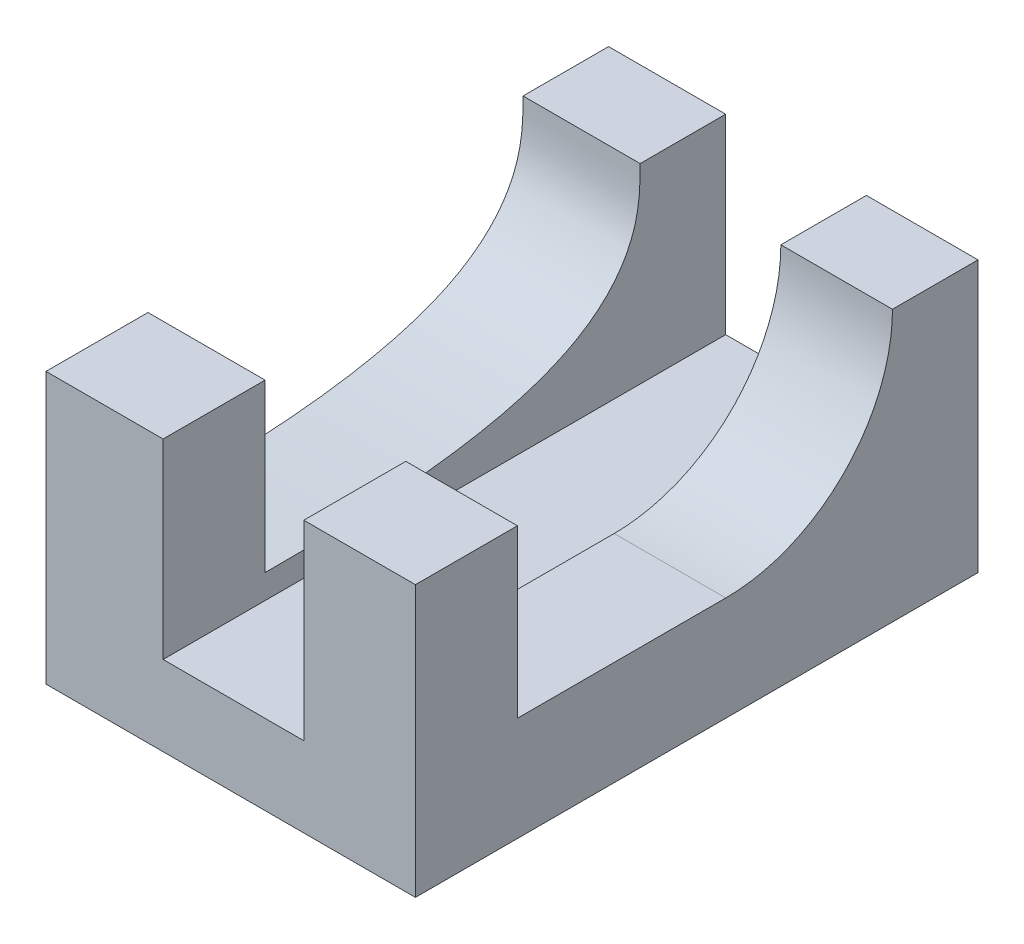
ISO-10303-21;
HEADER;
FILE_DESCRIPTION(('STEP AP214'),'2;1');
FILE_NAME('part.step','',(''),(''),'','','');
FILE_SCHEMA(('AUTOMOTIVE_DESIGN { 1 0 10303 214 1 1 1 1 }'));
ENDSEC;
DATA;
#1=APPLICATION_CONTEXT('core data for automotive mechanical design processes');
#2=APPLICATION_PROTOCOL_DEFINITION('international standard','automotive_design',2000,#1);
#3=PRODUCT_CONTEXT('',#1,'mechanical');
#4=PRODUCT('Part','Part','',(#3));
#5=PRODUCT_RELATED_PRODUCT_CATEGORY('part','',(#4));
#6=PRODUCT_DEFINITION_FORMATION('','',#4);
#7=PRODUCT_DEFINITION_CONTEXT('part definition',#1,'design');
#8=PRODUCT_DEFINITION('design','',#6,#7);
#9=PRODUCT_DEFINITION_SHAPE('','',#8);
#10=(LENGTH_UNIT() NAMED_UNIT(*) SI_UNIT(.MILLI.,.METRE.));
#11=(NAMED_UNIT(*) PLANE_ANGLE_UNIT() SI_UNIT($,.RADIAN.));
#12=(NAMED_UNIT(*) SI_UNIT($,.STERADIAN.) SOLID_ANGLE_UNIT());
#13=UNCERTAINTY_MEASURE_WITH_UNIT(LENGTH_MEASURE(1.E-05),#10,'distance_accuracy_value','');
#14=(GEOMETRIC_REPRESENTATION_CONTEXT(3) GLOBAL_UNCERTAINTY_ASSIGNED_CONTEXT((#13)) GLOBAL_UNIT_ASSIGNED_CONTEXT((#10,
#11,#12)) REPRESENTATION_CONTEXT('',''));
#15=CARTESIAN_POINT('',(0.,0.,0.));
#16=DIRECTION('',(0.,0.,1.));
#17=DIRECTION('',(1.,0.,0.));
#18=AXIS2_PLACEMENT_3D('',#15,#16,#17);
#19=CARTESIAN_POINT('',(-9.53202717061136,17.7663989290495,-17.3923694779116));
#20=CARTESIAN_POINT('',(-17.5203809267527,17.7663989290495,-17.3923694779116));
#21=CARTESIAN_POINT('',(-25.5087346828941,17.7663989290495,-17.3923694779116));
#22=CARTESIAN_POINT('',(-33.4970884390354,17.7663989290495,-17.3923694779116));
#23=CARTESIAN_POINT('',(-9.53202717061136,17.7663989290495,-28.1501547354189));
#24=CARTESIAN_POINT('',(-17.5203809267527,17.7663989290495,-28.1501547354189));
#25=CARTESIAN_POINT('',(-25.5087346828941,17.7663989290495,-28.1501547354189));
#26=CARTESIAN_POINT('',(-33.4970884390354,17.7663989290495,-28.1501547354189));
#27=CARTESIAN_POINT('',(-9.53202717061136,17.7663989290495,-38.9079399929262));
#28=CARTESIAN_POINT('',(-17.5203809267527,17.7663989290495,-38.9079399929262));
#29=CARTESIAN_POINT('',(-25.5087346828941,17.7663989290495,-38.9079399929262));
#30=CARTESIAN_POINT('',(-33.4970884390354,17.7663989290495,-38.9079399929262));
#31=CARTESIAN_POINT('',(-9.53202717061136,19.8043305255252,-62.6182376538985));
#32=CARTESIAN_POINT('',(-17.5203809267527,19.8043305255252,-62.6182376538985));
#33=CARTESIAN_POINT('',(-25.5087346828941,19.8043305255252,-62.6182376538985));
#34=CARTESIAN_POINT('',(-33.4970884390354,19.8043305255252,-62.6182376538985));
#35=CARTESIAN_POINT('',(-9.53202717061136,26.0922513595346,-76.7660595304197));
#36=CARTESIAN_POINT('',(-17.5203809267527,26.0922513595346,-76.7660595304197));
#37=CARTESIAN_POINT('',(-25.5087346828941,26.0922513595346,-76.7660595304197));
#38=CARTESIAN_POINT('',(-33.4970884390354,26.0922513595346,-76.7660595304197));
#39=CARTESIAN_POINT('',(-9.53202717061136,36.6301614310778,-81.3514056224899));
#40=CARTESIAN_POINT('',(-17.5203809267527,36.6301614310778,-81.3514056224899));
#41=CARTESIAN_POINT('',(-25.5087346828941,36.6301614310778,-81.3514056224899));
#42=CARTESIAN_POINT('',(-33.4970884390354,36.6301614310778,-81.3514056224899));
#43=CARTESIAN_POINT('',(-9.53202717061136,41.4113993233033,-81.3514056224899));
#44=CARTESIAN_POINT('',(-17.5203809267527,41.4113993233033,-81.3514056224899));
#45=CARTESIAN_POINT('',(-25.5087346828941,41.4113993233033,-81.3514056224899));
#46=CARTESIAN_POINT('',(-33.4970884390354,41.4113993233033,-81.3514056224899));
#47=CARTESIAN_POINT('',(-9.53202717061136,46.1926372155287,-81.3514056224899));
#48=CARTESIAN_POINT('',(-17.5203809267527,46.1926372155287,-81.3514056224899));
#49=CARTESIAN_POINT('',(-25.5087346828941,46.1926372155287,-81.3514056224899));
#50=CARTESIAN_POINT('',(-33.4970884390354,46.1926372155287,-81.3514056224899));
#51=B_SPLINE_SURFACE_WITH_KNOTS('',5,3,((#19,#20,#21,#22),(#23,#24,#25,#26),(#27,#28,#29,#30),
(#31,#32,#33,#34),(#35,#36,#37,#38),(#39,#40,#41,#42),(#43,#44,#45,#46),(#47,#48,#49,#50)),
.UNSPECIFIED.,.F.,.F.,.F.,(6,2,6),(4,4),(0.,0.5,1.),(0.0410320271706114,0.0649970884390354),.UNSPECIFIED.);
#52=CARTESIAN_POINT('',(-9.53202717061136,46.1926372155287,-81.3514056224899));
#53=CARTESIAN_POINT('',(-17.5203809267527,46.1926372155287,-81.3514056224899));
#54=CARTESIAN_POINT('',(-25.5087346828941,46.1926372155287,-81.3514056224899));
#55=CARTESIAN_POINT('',(-33.4970884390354,46.1926372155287,-81.3514056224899));
#56=B_SPLINE_CURVE_WITH_KNOTS('',3,(#52,#53,#54,#55),.UNSPECIFIED.,.F.,.F.,(4,4),
(0.0410320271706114,0.0649970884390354),.UNSPECIFIED.);
#57=CARTESIAN_POINT('',(-11.5291156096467,46.1926372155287,-81.3514056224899));
#58=VERTEX_POINT('',#57);
#59=CARTESIAN_POINT('',(-31.5,46.1926372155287,-81.3514056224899));
#60=VERTEX_POINT('',#59);
#61=EDGE_CURVE('E325',#58,#60,#56,.T.);
#62=CARTESIAN_POINT('',(-31.5,46.1926372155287,-81.3514056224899));
#63=CARTESIAN_POINT('',(-31.5,41.4113993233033,-81.3514056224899));
#64=CARTESIAN_POINT('',(-31.5,36.6301614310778,-81.3514056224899));
#65=CARTESIAN_POINT('',(-31.5,26.0922513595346,-76.7660595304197));
#66=CARTESIAN_POINT('',(-31.5,19.8043305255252,-62.6182376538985));
#67=CARTESIAN_POINT('',(-31.5,17.7663989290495,-38.9079399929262));
#68=CARTESIAN_POINT('',(-31.5,17.7663989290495,-28.1501547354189));
#69=CARTESIAN_POINT('',(-31.5,17.7663989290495,-17.3923694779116));
#70=B_SPLINE_CURVE_WITH_KNOTS('',5,(#62,#63,#64,#65,#66,#67,#68,#69),.UNSPECIFIED.,.F.,.F.,(6,2,
6),(0.,0.5,1.),.UNSPECIFIED.);
#71=CARTESIAN_POINT('',(-31.5,17.7663989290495,-17.3923694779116));
#72=VERTEX_POINT('',#71);
#73=EDGE_CURVE('E39',#60,#72,#70,.T.);
#74=CARTESIAN_POINT('',(-33.4970884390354,17.7663989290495,-17.3923694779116));
#75=CARTESIAN_POINT('',(-25.5087346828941,17.7663989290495,-17.3923694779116));
#76=CARTESIAN_POINT('',(-17.5203809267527,17.7663989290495,-17.3923694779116));
#77=CARTESIAN_POINT('',(-9.53202717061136,17.7663989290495,-17.3923694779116));
#78=B_SPLINE_CURVE_WITH_KNOTS('',3,(#74,#75,#76,#77),.UNSPECIFIED.,.F.,.F.,(4,4),
(0.0410320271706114,0.0649970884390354),.UNSPECIFIED.);
#79=CARTESIAN_POINT('',(-11.5291156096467,17.7663989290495,-17.3923694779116));
#80=VERTEX_POINT('',#79);
#81=EDGE_CURVE('E280',#80,#72,#78,.F.);
#82=CARTESIAN_POINT('',(-11.5291156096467,17.7663989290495,-17.3923694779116));
#83=CARTESIAN_POINT('',(-11.5291156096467,17.7663989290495,-28.1501547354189));
#84=CARTESIAN_POINT('',(-11.5291156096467,17.7663989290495,-38.9079399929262));
#85=CARTESIAN_POINT('',(-11.5291156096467,19.8043305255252,-62.6182376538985));
#86=CARTESIAN_POINT('',(-11.5291156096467,26.0922513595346,-76.7660595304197));
#87=CARTESIAN_POINT('',(-11.5291156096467,36.6301614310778,-81.3514056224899));
#88=CARTESIAN_POINT('',(-11.5291156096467,41.4113993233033,-81.3514056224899));
#89=CARTESIAN_POINT('',(-11.5291156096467,46.1926372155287,-81.3514056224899));
#90=B_SPLINE_CURVE_WITH_KNOTS('',5,(#82,#83,#84,#85,#86,#87,#88,#89),.UNSPECIFIED.,.F.,.F.,(6,2,
6),(0.,0.5,1.),.UNSPECIFIED.);
#91=EDGE_CURVE('E11',#80,#58,#90,.T.);
#92=ORIENTED_EDGE('',*,*,#61,.T.);
#93=ORIENTED_EDGE('',*,*,#73,.T.);
#94=ORIENTED_EDGE('',*,*,#81,.F.);
#95=ORIENTED_EDGE('',*,*,#91,.T.);
#96=EDGE_LOOP('',(#92,#93,#94,#95));
#97=FACE_BOUND('',#96,.T.);
#98=ADVANCED_FACE('F26',(#97),#51,.T.);
#99=CARTESIAN_POINT('',(33.4033557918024,17.7663989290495,-52.9251673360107));
#100=CARTESIAN_POINT('',(25.7899326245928,17.7663989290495,-52.9251673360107));
#101=CARTESIAN_POINT('',(18.176509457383,17.7663989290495,-52.9251673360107));
#102=CARTESIAN_POINT('',(10.5630862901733,17.7663989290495,-52.9251673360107));
#103=CARTESIAN_POINT('',(33.4033557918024,17.7663989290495,-81.3514056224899));
#104=CARTESIAN_POINT('',(25.7899326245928,17.7663989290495,-81.3514056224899));
#105=CARTESIAN_POINT('',(18.176509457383,17.7663989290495,-81.3514056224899));
#106=CARTESIAN_POINT('',(10.5630862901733,17.7663989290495,-81.3514056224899));
#107=CARTESIAN_POINT('',(33.4033557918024,46.1926372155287,-81.3514056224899));
#108=CARTESIAN_POINT('',(25.7899326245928,46.1926372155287,-81.3514056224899));
#109=CARTESIAN_POINT('',(18.176509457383,46.1926372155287,-81.3514056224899));
#110=CARTESIAN_POINT('',(10.5630862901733,46.1926372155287,-81.3514056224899));
#111=(BOUNDED_SURFACE() B_SPLINE_SURFACE(2,3,((#99,#100,#101,#102),(#103,#104,#105,#106),(#107,
#108,#109,#110)),.UNSPECIFIED.,.F.,.F.,.F.) B_SPLINE_SURFACE_WITH_KNOTS((3,3),(4,4),(0.,1.),
(-0.00190335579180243,0.0209369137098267),
.UNSPECIFIED.) GEOMETRIC_REPRESENTATION_ITEM() RATIONAL_B_SPLINE_SURFACE(((1.,1.,1.,1.),
(0.707106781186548,0.707106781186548,0.707106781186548,0.707106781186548),(1.,1.,1.,1.))) REPRESENTATION_ITEM('') SURFACE());
#112=CARTESIAN_POINT('',(33.4033557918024,46.1926372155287,-81.3514056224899));
#113=CARTESIAN_POINT('',(25.7899326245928,46.1926372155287,-81.3514056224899));
#114=CARTESIAN_POINT('',(18.176509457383,46.1926372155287,-81.3514056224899));
#115=CARTESIAN_POINT('',(10.5630862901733,46.1926372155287,-81.3514056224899));
#116=(BOUNDED_CURVE() B_SPLINE_CURVE(3,(#112,#113,#114,#115),.UNSPECIFIED.,.F.,
.F.) B_SPLINE_CURVE_WITH_KNOTS((4,4),(-0.00190335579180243,0.0209369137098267),
.UNSPECIFIED.) CURVE() GEOMETRIC_REPRESENTATION_ITEM() RATIONAL_B_SPLINE_CURVE((1.,1.,1.,1.)) REPRESENTATION_ITEM(''));
#117=CARTESIAN_POINT('',(31.5,46.1926372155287,-81.3514056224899));
#118=VERTEX_POINT('',#117);
#119=CARTESIAN_POINT('',(12.4664420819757,46.1926372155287,-81.3514056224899));
#120=VERTEX_POINT('',#119);
#121=EDGE_CURVE('E231',#118,#120,#116,.T.);
#122=CARTESIAN_POINT('',(12.4664420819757,46.1926372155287,-81.3514056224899));
#123=CARTESIAN_POINT('',(12.4664420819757,17.7663989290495,-81.3514056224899));
#124=CARTESIAN_POINT('',(12.4664420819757,17.7663989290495,-52.9251673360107));
#125=(BOUNDED_CURVE() B_SPLINE_CURVE(2,(#122,#123,#124),.UNSPECIFIED.,.F.,
.F.) B_SPLINE_CURVE_WITH_KNOTS((3,3),(0.,1.),
.UNSPECIFIED.) CURVE() GEOMETRIC_REPRESENTATION_ITEM() RATIONAL_B_SPLINE_CURVE((1.,
0.707106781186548,1.)) REPRESENTATION_ITEM(''));
#126=CARTESIAN_POINT('',(12.4664420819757,17.7663989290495,-52.9251673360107));
#127=VERTEX_POINT('',#126);
#128=EDGE_CURVE('E54',#120,#127,#125,.T.);
#129=CARTESIAN_POINT('',(10.5630862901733,17.7663989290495,-52.9251673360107));
#130=CARTESIAN_POINT('',(18.176509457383,17.7663989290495,-52.9251673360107));
#131=CARTESIAN_POINT('',(25.7899326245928,17.7663989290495,-52.9251673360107));
#132=CARTESIAN_POINT('',(33.4033557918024,17.7663989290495,-52.9251673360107));
#133=(BOUNDED_CURVE() B_SPLINE_CURVE(3,(#129,#130,#131,#132),.UNSPECIFIED.,.F.,
.F.) B_SPLINE_CURVE_WITH_KNOTS((4,4),(-0.00190335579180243,0.0209369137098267),
.UNSPECIFIED.) CURVE() GEOMETRIC_REPRESENTATION_ITEM() RATIONAL_B_SPLINE_CURVE((1.,1.,1.,1.)) REPRESENTATION_ITEM(''));
#134=CARTESIAN_POINT('',(31.5,17.7663989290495,-52.9251673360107));
#135=VERTEX_POINT('',#134);
#136=EDGE_CURVE('E185',#135,#127,#133,.F.);
#137=CARTESIAN_POINT('',(31.5,17.7663989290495,-52.9251673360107));
#138=CARTESIAN_POINT('',(31.5,17.7663989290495,-81.3514056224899));
#139=CARTESIAN_POINT('',(31.5,46.1926372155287,-81.3514056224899));
#140=(BOUNDED_CURVE() B_SPLINE_CURVE(2,(#137,#138,#139),.UNSPECIFIED.,.F.,
.F.) B_SPLINE_CURVE_WITH_KNOTS((3,3),(0.,1.),
.UNSPECIFIED.) CURVE() GEOMETRIC_REPRESENTATION_ITEM() RATIONAL_B_SPLINE_CURVE((1.,
0.707106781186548,1.)) REPRESENTATION_ITEM(''));
#141=EDGE_CURVE('E46',#135,#118,#140,.T.);
#142=ORIENTED_EDGE('',*,*,#121,.T.);
#143=ORIENTED_EDGE('',*,*,#128,.T.);
#144=ORIENTED_EDGE('',*,*,#136,.F.);
#145=ORIENTED_EDGE('',*,*,#141,.T.);
#146=EDGE_LOOP('',(#142,#143,#144,#145));
#147=FACE_BOUND('',#146,.T.);
#148=ADVANCED_FACE('F190',(#147),#111,.T.);
#149=CARTESIAN_POINT('',(31.5,46.1926372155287,-17.3923694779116));
#150=DIRECTION('',(0.,-1.,0.));
#151=DIRECTION('',(0.,0.,-1.));
#152=AXIS2_PLACEMENT_3D('',#149,#150,#151);
#153=PLANE('',#152);
#154=DIRECTION('',(-1.,0.,0.));
#155=VECTOR('',#154,1.);
#156=CARTESIAN_POINT('',(31.5,46.1926372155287,-17.3923694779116));
#157=LINE('',#156,#155);
#158=CARTESIAN_POINT('',(31.5,46.1926372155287,-17.3923694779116));
#159=VERTEX_POINT('',#158);
#160=CARTESIAN_POINT('',(12.4664420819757,46.1926372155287,-17.3923694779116));
#161=VERTEX_POINT('',#160);
#162=EDGE_CURVE('E409',#159,#161,#157,.T.);
#163=ORIENTED_EDGE('',*,*,#162,.T.);
#164=DIRECTION('',(0.,0.,-1.));
#165=VECTOR('',#164,1.);
#166=CARTESIAN_POINT('',(12.4664420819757,46.1926372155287,0.));
#167=LINE('',#166,#165);
#168=CARTESIAN_POINT('',(12.4664420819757,46.1926372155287,0.));
#169=VERTEX_POINT('',#168);
#170=EDGE_CURVE('E172',#169,#161,#167,.T.);
#171=ORIENTED_EDGE('',*,*,#170,.F.);
#172=DIRECTION('',(-1.,0.,0.));
#173=VECTOR('',#172,1.);
#174=CARTESIAN_POINT('',(31.5,46.1926372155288,0.));
#175=LINE('',#174,#173);
#176=CARTESIAN_POINT('',(31.5,46.1926372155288,0.));
#177=VERTEX_POINT('',#176);
#178=EDGE_CURVE('E370',#177,#169,#175,.T.);
#179=ORIENTED_EDGE('',*,*,#178,.F.);
#180=DIRECTION('',(0.,0.,1.));
#181=VECTOR('',#180,1.);
#182=CARTESIAN_POINT('',(31.5,46.1926372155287,-17.3923694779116));
#183=LINE('',#182,#181);
#184=EDGE_CURVE('E397',#159,#177,#183,.T.);
#185=ORIENTED_EDGE('',*,*,#184,.F.);
#186=EDGE_LOOP('',(#163,#171,#179,#185));
#187=FACE_BOUND('',#186,.T.);
#188=ADVANCED_FACE('F201',(#187),#153,.F.);
#189=CARTESIAN_POINT('',(31.5,46.1926372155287,-95.9385542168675));
#190=DIRECTION('',(0.,-1.,0.));
#191=DIRECTION('',(0.,0.,-1.));
#192=AXIS2_PLACEMENT_3D('',#189,#190,#191);
#193=PLANE('',#192);
#194=DIRECTION('',(-1.,0.,0.));
#195=VECTOR('',#194,1.);
#196=CARTESIAN_POINT('',(31.5,46.1926372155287,-95.9385542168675));
#197=LINE('',#196,#195);
#198=CARTESIAN_POINT('',(31.5,46.1926372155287,-95.9385542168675));
#199=VERTEX_POINT('',#198);
#200=CARTESIAN_POINT('',(12.4664420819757,46.1926372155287,-95.9385542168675));
#201=VERTEX_POINT('',#200);
#202=EDGE_CURVE('E414',#199,#201,#197,.T.);
#203=ORIENTED_EDGE('',*,*,#202,.T.);
#204=EDGE_CURVE('E156',#120,#201,#167,.T.);
#205=ORIENTED_EDGE('',*,*,#204,.F.);
#206=ORIENTED_EDGE('',*,*,#121,.F.);
#207=DIRECTION('',(0.,0.,1.));
#208=VECTOR('',#207,1.);
#209=CARTESIAN_POINT('',(31.5,46.1926372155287,-95.9385542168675));
#210=LINE('',#209,#208);
#211=EDGE_CURVE('E235',#199,#118,#210,.T.);
#212=ORIENTED_EDGE('',*,*,#211,.F.);
#213=EDGE_LOOP('',(#203,#205,#206,#212));
#214=FACE_BOUND('',#213,.T.);
#215=ADVANCED_FACE('F248',(#214),#193,.F.);
#216=CARTESIAN_POINT('',(31.5,17.7663989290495,-81.3514056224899));
#217=DIRECTION('',(0.,-1.,0.));
#218=DIRECTION('',(0.,0.,-1.));
#219=AXIS2_PLACEMENT_3D('',#216,#217,#218);
#220=PLANE('',#219);
#221=DIRECTION('',(0.,0.,1.));
#222=VECTOR('',#221,1.);
#223=CARTESIAN_POINT('',(31.5,17.7663989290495,-81.3514056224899));
#224=LINE('',#223,#222);
#225=CARTESIAN_POINT('',(31.5,17.7663989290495,-17.3923694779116));
#226=VERTEX_POINT('',#225);
#227=EDGE_CURVE('E385',#135,#226,#224,.T.);
#228=ORIENTED_EDGE('',*,*,#227,.F.);
#229=ORIENTED_EDGE('',*,*,#136,.T.);
#230=DIRECTION('',(0.,0.,1.));
#231=VECTOR('',#230,1.);
#232=CARTESIAN_POINT('',(12.4664420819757,17.7663989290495,-81.3514056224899));
#233=LINE('',#232,#231);
#234=CARTESIAN_POINT('',(12.4664420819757,17.7663989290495,-17.3923694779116));
#235=VERTEX_POINT('',#234);
#236=EDGE_CURVE('E175',#127,#235,#233,.T.);
#237=ORIENTED_EDGE('',*,*,#236,.T.);
#238=DIRECTION('',(-1.,0.,0.));
#239=VECTOR('',#238,1.);
#240=CARTESIAN_POINT('',(31.5,17.7663989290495,-17.3923694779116));
#241=LINE('',#240,#239);
#242=EDGE_CURVE('E336',#226,#235,#241,.T.);
#243=ORIENTED_EDGE('',*,*,#242,.F.);
#244=EDGE_LOOP('',(#228,#229,#237,#243));
#245=FACE_BOUND('',#244,.T.);
#246=ADVANCED_FACE('F249',(#245),#220,.F.);
#247=CARTESIAN_POINT('',(31.5,17.7663989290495,-17.3923694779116));
#248=DIRECTION('',(0.,0.,1.));
#249=DIRECTION('',(0.,-1.,0.));
#250=AXIS2_PLACEMENT_3D('',#247,#248,#249);
#251=PLANE('',#250);
#252=ORIENTED_EDGE('',*,*,#242,.T.);
#253=DIRECTION('',(0.,1.,0.));
#254=VECTOR('',#253,1.);
#255=CARTESIAN_POINT('',(12.4664420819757,17.7663989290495,-17.3923694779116));
#256=LINE('',#255,#254);
#257=EDGE_CURVE('E369',#235,#161,#256,.T.);
#258=ORIENTED_EDGE('',*,*,#257,.T.);
#259=ORIENTED_EDGE('',*,*,#162,.F.);
#260=DIRECTION('',(0.,1.,0.));
#261=VECTOR('',#260,1.);
#262=CARTESIAN_POINT('',(31.5,17.7663989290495,-17.3923694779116));
#263=LINE('',#262,#261);
#264=EDGE_CURVE('E407',#226,#159,#263,.T.);
#265=ORIENTED_EDGE('',*,*,#264,.F.);
#266=EDGE_LOOP('',(#252,#258,#259,#265));
#267=FACE_BOUND('',#266,.T.);
#268=ADVANCED_FACE('F308',(#267),#251,.F.);
#269=CARTESIAN_POINT('',(-11.5291156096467,46.1926372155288,0.));
#270=VERTEX_POINT('',#269);
#271=CARTESIAN_POINT('',(-31.5,46.1926372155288,0.));
#272=VERTEX_POINT('',#271);
#273=EDGE_CURVE('E374',#270,#272,#175,.T.);
#274=ORIENTED_EDGE('',*,*,#273,.F.);
#275=DIRECTION('',(0.,0.,-1.));
#276=VECTOR('',#275,1.);
#277=CARTESIAN_POINT('',(-11.5291156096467,46.1926372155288,0.));
#278=LINE('',#277,#276);
#279=CARTESIAN_POINT('',(-11.5291156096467,46.1926372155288,-17.3923694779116));
#280=VERTEX_POINT('',#279);
#281=EDGE_CURVE('E176',#270,#280,#278,.T.);
#282=ORIENTED_EDGE('',*,*,#281,.T.);
#283=CARTESIAN_POINT('',(-31.5,46.1926372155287,-17.3923694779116));
#284=VERTEX_POINT('',#283);
#285=EDGE_CURVE('E368',#280,#284,#157,.T.);
#286=ORIENTED_EDGE('',*,*,#285,.T.);
#287=DIRECTION('',(0.,0.,1.));
#288=VECTOR('',#287,1.);
#289=CARTESIAN_POINT('',(-31.5,46.1926372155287,-17.3923694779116));
#290=LINE('',#289,#288);
#291=EDGE_CURVE('E384',#284,#272,#290,.T.);
#292=ORIENTED_EDGE('',*,*,#291,.T.);
#293=EDGE_LOOP('',(#274,#282,#286,#292));
#294=FACE_BOUND('',#293,.T.);
#295=ADVANCED_FACE('F202',(#294),#153,.F.);
#296=CARTESIAN_POINT('',(31.5,46.1926372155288,0.));
#297=DIRECTION('',(0.,0.,-1.));
#298=DIRECTION('',(-1.,0.,0.));
#299=AXIS2_PLACEMENT_3D('',#296,#297,#298);
#300=PLANE('',#299);
#301=ORIENTED_EDGE('',*,*,#178,.T.);
#302=DIRECTION('',(0.,-1.,0.));
#303=VECTOR('',#302,1.);
#304=CARTESIAN_POINT('',(12.4664420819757,46.1926372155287,0.));
#305=LINE('',#304,#303);
#306=CARTESIAN_POINT('',(12.4664420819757,13.6293212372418,0.));
#307=VERTEX_POINT('',#306);
#308=EDGE_CURVE('E165',#169,#307,#305,.T.);
#309=ORIENTED_EDGE('',*,*,#308,.T.);
#310=DIRECTION('',(-1.,0.,0.));
#311=VECTOR('',#310,1.);
#312=CARTESIAN_POINT('',(12.4664420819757,13.6293212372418,0.));
#313=LINE('',#312,#311);
#314=CARTESIAN_POINT('',(-11.5291156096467,13.6293212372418,0.));
#315=VERTEX_POINT('',#314);
#316=EDGE_CURVE('E146',#307,#315,#313,.T.);
#317=ORIENTED_EDGE('',*,*,#316,.T.);
#318=DIRECTION('',(0.,1.,0.));
#319=VECTOR('',#318,1.);
#320=CARTESIAN_POINT('',(-11.5291156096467,46.1926372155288,0.));
#321=LINE('',#320,#319);
#322=EDGE_CURVE('E150',#315,#270,#321,.T.);
#323=ORIENTED_EDGE('',*,*,#322,.T.);
#324=ORIENTED_EDGE('',*,*,#273,.T.);
#325=DIRECTION('',(0.,-1.,0.));
#326=VECTOR('',#325,1.);
#327=CARTESIAN_POINT('',(-31.5,46.1926372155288,0.));
#328=LINE('',#327,#326);
#329=CARTESIAN_POINT('',(-31.5,0.,0.));
#330=VERTEX_POINT('',#329);
#331=EDGE_CURVE('E392',#272,#330,#328,.T.);
#332=ORIENTED_EDGE('',*,*,#331,.T.);
#333=DIRECTION('',(-1.,0.,0.));
#334=VECTOR('',#333,1.);
#335=CARTESIAN_POINT('',(31.5,0.,0.));
#336=LINE('',#335,#334);
#337=CARTESIAN_POINT('',(31.5,0.,0.));
#338=VERTEX_POINT('',#337);
#339=EDGE_CURVE('E378',#338,#330,#336,.T.);
#340=ORIENTED_EDGE('',*,*,#339,.F.);
#341=DIRECTION('',(0.,-1.,0.));
#342=VECTOR('',#341,1.);
#343=CARTESIAN_POINT('',(31.5,46.1926372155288,0.));
#344=LINE('',#343,#342);
#345=EDGE_CURVE('E400',#177,#338,#344,.T.);
#346=ORIENTED_EDGE('',*,*,#345,.F.);
#347=EDGE_LOOP('',(#301,#309,#317,#323,#324,#332,#340,#346));
#348=FACE_BOUND('',#347,.T.);
#349=ADVANCED_FACE('F432',(#348),#300,.F.);
#350=CARTESIAN_POINT('',(31.5,0.,0.));
#351=DIRECTION('',(0.,1.,0.));
#352=DIRECTION('',(0.,0.,1.));
#353=AXIS2_PLACEMENT_3D('',#350,#351,#352);
#354=PLANE('',#353);
#355=DIRECTION('',(0.,0.,-1.));
#356=VECTOR('',#355,1.);
#357=CARTESIAN_POINT('',(-31.5,0.,0.));
#358=LINE('',#357,#356);
#359=CARTESIAN_POINT('',(-31.5,0.,-95.9385542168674));
#360=VERTEX_POINT('',#359);
#361=EDGE_CURVE('E394',#330,#360,#358,.T.);
#362=ORIENTED_EDGE('',*,*,#361,.T.);
#363=DIRECTION('',(-1.,0.,0.));
#364=VECTOR('',#363,1.);
#365=CARTESIAN_POINT('',(31.5,0.,-95.9385542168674));
#366=LINE('',#365,#364);
#367=CARTESIAN_POINT('',(31.5,0.,-95.9385542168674));
#368=VERTEX_POINT('',#367);
#369=EDGE_CURVE('E415',#368,#360,#366,.T.);
#370=ORIENTED_EDGE('',*,*,#369,.F.);
#371=DIRECTION('',(0.,0.,-1.));
#372=VECTOR('',#371,1.);
#373=CARTESIAN_POINT('',(31.5,0.,0.));
#374=LINE('',#373,#372);
#375=EDGE_CURVE('E402',#338,#368,#374,.T.);
#376=ORIENTED_EDGE('',*,*,#375,.F.);
#377=ORIENTED_EDGE('',*,*,#339,.T.);
#378=EDGE_LOOP('',(#362,#370,#376,#377));
#379=FACE_BOUND('',#378,.T.);
#380=ADVANCED_FACE('F423',(#379),#354,.F.);
#381=CARTESIAN_POINT('',(31.5,0.,-95.9385542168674));
#382=DIRECTION('',(0.,0.,1.));
#383=DIRECTION('',(0.,-1.,0.));
#384=AXIS2_PLACEMENT_3D('',#381,#382,#383);
#385=PLANE('',#384);
#386=DIRECTION('',(-1.,0.,0.));
#387=VECTOR('',#386,1.);
#388=CARTESIAN_POINT('',(12.4664420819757,13.6293212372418,-95.9385542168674));
#389=LINE('',#388,#387);
#390=CARTESIAN_POINT('',(12.4664420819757,13.6293212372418,-95.9385542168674));
#391=VERTEX_POINT('',#390);
#392=CARTESIAN_POINT('',(-11.5291156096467,13.6293212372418,-95.9385542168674));
#393=VERTEX_POINT('',#392);
#394=EDGE_CURVE('E143',#391,#393,#389,.T.);
#395=ORIENTED_EDGE('',*,*,#394,.F.);
#396=DIRECTION('',(0.,-1.,0.));
#397=VECTOR('',#396,1.);
#398=CARTESIAN_POINT('',(12.4664420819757,46.1926372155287,-95.9385542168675));
#399=LINE('',#398,#397);
#400=EDGE_CURVE('E153',#201,#391,#399,.T.);
#401=ORIENTED_EDGE('',*,*,#400,.F.);
#402=ORIENTED_EDGE('',*,*,#202,.F.);
#403=DIRECTION('',(0.,1.,0.));
#404=VECTOR('',#403,1.);
#405=CARTESIAN_POINT('',(31.5,0.,-95.9385542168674));
#406=LINE('',#405,#404);
#407=EDGE_CURVE('E404',#368,#199,#406,.T.);
#408=ORIENTED_EDGE('',*,*,#407,.F.);
#409=ORIENTED_EDGE('',*,*,#369,.T.);
#410=DIRECTION('',(0.,1.,0.));
#411=VECTOR('',#410,1.);
#412=CARTESIAN_POINT('',(-31.5,0.,-95.9385542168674));
#413=LINE('',#412,#411);
#414=CARTESIAN_POINT('',(-31.5,46.1926372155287,-95.9385542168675));
#415=VERTEX_POINT('',#414);
#416=EDGE_CURVE('E273',#360,#415,#413,.T.);
#417=ORIENTED_EDGE('',*,*,#416,.T.);
#418=CARTESIAN_POINT('',(-11.5291156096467,46.1926372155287,-95.9385542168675));
#419=VERTEX_POINT('',#418);
#420=EDGE_CURVE('E338',#419,#415,#197,.T.);
#421=ORIENTED_EDGE('',*,*,#420,.F.);
#422=DIRECTION('',(0.,1.,0.));
#423=VECTOR('',#422,1.);
#424=CARTESIAN_POINT('',(-11.5291156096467,46.1926372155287,-95.9385542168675));
#425=LINE('',#424,#423);
#426=EDGE_CURVE('E163',#393,#419,#425,.T.);
#427=ORIENTED_EDGE('',*,*,#426,.F.);
#428=EDGE_LOOP('',(#395,#401,#402,#408,#409,#417,#421,#427));
#429=FACE_BOUND('',#428,.T.);
#430=ADVANCED_FACE('F161',(#429),#385,.F.);
#431=ORIENTED_EDGE('',*,*,#61,.F.);
#432=EDGE_CURVE('E261',#58,#419,#278,.T.);
#433=ORIENTED_EDGE('',*,*,#432,.T.);
#434=ORIENTED_EDGE('',*,*,#420,.T.);
#435=DIRECTION('',(0.,0.,1.));
#436=VECTOR('',#435,1.);
#437=CARTESIAN_POINT('',(-31.5,46.1926372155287,-95.9385542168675));
#438=LINE('',#437,#436);
#439=EDGE_CURVE('E269',#415,#60,#438,.T.);
#440=ORIENTED_EDGE('',*,*,#439,.T.);
#441=EDGE_LOOP('',(#431,#433,#434,#440));
#442=FACE_BOUND('',#441,.T.);
#443=ADVANCED_FACE('F236',(#442),#193,.F.);
#444=ORIENTED_EDGE('',*,*,#285,.F.);
#445=DIRECTION('',(0.,-1.,0.));
#446=VECTOR('',#445,1.);
#447=CARTESIAN_POINT('',(-11.5291156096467,17.7663989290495,-17.3923694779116));
#448=LINE('',#447,#446);
#449=EDGE_CURVE('E297',#280,#80,#448,.T.);
#450=ORIENTED_EDGE('',*,*,#449,.T.);
#451=ORIENTED_EDGE('',*,*,#81,.T.);
#452=DIRECTION('',(0.,1.,0.));
#453=VECTOR('',#452,1.);
#454=CARTESIAN_POINT('',(-31.5,17.7663989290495,-17.3923694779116));
#455=LINE('',#454,#453);
#456=EDGE_CURVE('E272',#72,#284,#455,.T.);
#457=ORIENTED_EDGE('',*,*,#456,.T.);
#458=EDGE_LOOP('',(#444,#450,#451,#457));
#459=FACE_BOUND('',#458,.T.);
#460=ADVANCED_FACE('F246',(#459),#251,.F.);
#461=CARTESIAN_POINT('',(31.5,46.1926372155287,-17.3923694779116));
#462=DIRECTION('',(-1.,0.,0.));
#463=DIRECTION('',(0.,0.,1.));
#464=AXIS2_PLACEMENT_3D('',#461,#462,#463);
#465=PLANE('',#464);
#466=ORIENTED_EDGE('',*,*,#141,.F.);
#467=ORIENTED_EDGE('',*,*,#227,.T.);
#468=ORIENTED_EDGE('',*,*,#264,.T.);
#469=ORIENTED_EDGE('',*,*,#184,.T.);
#470=ORIENTED_EDGE('',*,*,#345,.T.);
#471=ORIENTED_EDGE('',*,*,#375,.T.);
#472=ORIENTED_EDGE('',*,*,#407,.T.);
#473=ORIENTED_EDGE('',*,*,#211,.T.);
#474=EDGE_LOOP('',(#466,#467,#468,#469,#470,#471,#472,#473));
#475=FACE_BOUND('',#474,.T.);
#476=ADVANCED_FACE('F307',(#475),#465,.F.);
#477=CARTESIAN_POINT('',(-31.5,46.1926372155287,-17.3923694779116));
#478=DIRECTION('',(-1.,0.,0.));
#479=DIRECTION('',(0.,0.,1.));
#480=AXIS2_PLACEMENT_3D('',#477,#478,#479);
#481=PLANE('',#480);
#482=ORIENTED_EDGE('',*,*,#291,.F.);
#483=ORIENTED_EDGE('',*,*,#456,.F.);
#484=ORIENTED_EDGE('',*,*,#73,.F.);
#485=ORIENTED_EDGE('',*,*,#439,.F.);
#486=ORIENTED_EDGE('',*,*,#416,.F.);
#487=ORIENTED_EDGE('',*,*,#361,.F.);
#488=ORIENTED_EDGE('',*,*,#331,.F.);
#489=EDGE_LOOP('',(#482,#483,#484,#485,#486,#487,#488));
#490=FACE_BOUND('',#489,.T.);
#491=ADVANCED_FACE('F312',(#490),#481,.T.);
#492=CARTESIAN_POINT('',(12.4664420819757,46.1926372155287,0.));
#493=DIRECTION('',(1.,0.,0.));
#494=DIRECTION('',(0.,1.,0.));
#495=AXIS2_PLACEMENT_3D('',#492,#493,#494);
#496=PLANE('',#495);
#497=ORIENTED_EDGE('',*,*,#204,.T.);
#498=ORIENTED_EDGE('',*,*,#400,.T.);
#499=DIRECTION('',(0.,0.,-1.));
#500=VECTOR('',#499,1.);
#501=CARTESIAN_POINT('',(12.4664420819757,13.6293212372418,0.));
#502=LINE('',#501,#500);
#503=EDGE_CURVE('E139',#307,#391,#502,.T.);
#504=ORIENTED_EDGE('',*,*,#503,.F.);
#505=ORIENTED_EDGE('',*,*,#308,.F.);
#506=ORIENTED_EDGE('',*,*,#170,.T.);
#507=ORIENTED_EDGE('',*,*,#257,.F.);
#508=ORIENTED_EDGE('',*,*,#236,.F.);
#509=ORIENTED_EDGE('',*,*,#128,.F.);
#510=EDGE_LOOP('',(#497,#498,#504,#505,#506,#507,#508,#509));
#511=FACE_BOUND('',#510,.T.);
#512=ADVANCED_FACE('F154',(#511),#496,.F.);
#513=CARTESIAN_POINT('',(-11.5291156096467,46.1926372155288,0.));
#514=DIRECTION('',(-1.,0.,0.));
#515=DIRECTION('',(0.,-1.,0.));
#516=AXIS2_PLACEMENT_3D('',#513,#514,#515);
#517=PLANE('',#516);
#518=ORIENTED_EDGE('',*,*,#91,.F.);
#519=ORIENTED_EDGE('',*,*,#449,.F.);
#520=ORIENTED_EDGE('',*,*,#281,.F.);
#521=ORIENTED_EDGE('',*,*,#322,.F.);
#522=DIRECTION('',(0.,0.,-1.));
#523=VECTOR('',#522,1.);
#524=CARTESIAN_POINT('',(-11.5291156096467,13.6293212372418,0.));
#525=LINE('',#524,#523);
#526=EDGE_CURVE('E149',#315,#393,#525,.T.);
#527=ORIENTED_EDGE('',*,*,#526,.T.);
#528=ORIENTED_EDGE('',*,*,#426,.T.);
#529=ORIENTED_EDGE('',*,*,#432,.F.);
#530=EDGE_LOOP('',(#518,#519,#520,#521,#527,#528,#529));
#531=FACE_BOUND('',#530,.T.);
#532=ADVANCED_FACE('F365',(#531),#517,.F.);
#533=CARTESIAN_POINT('',(12.4664420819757,13.6293212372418,0.));
#534=DIRECTION('',(0.,-1.,0.));
#535=DIRECTION('',(1.,0.,0.));
#536=AXIS2_PLACEMENT_3D('',#533,#534,#535);
#537=PLANE('',#536);
#538=ORIENTED_EDGE('',*,*,#394,.T.);
#539=ORIENTED_EDGE('',*,*,#526,.F.);
#540=ORIENTED_EDGE('',*,*,#316,.F.);
#541=ORIENTED_EDGE('',*,*,#503,.T.);
#542=EDGE_LOOP('',(#538,#539,#540,#541));
#543=FACE_BOUND('',#542,.T.);
#544=ADVANCED_FACE('F141',(#543),#537,.F.);
#545=CLOSED_SHELL('',(#98,#148,#188,#215,#246,#268,#295,#349,#380,#430,#443,#460,#476,#491,#512,
#532,#544));
#546=MANIFOLD_SOLID_BREP('B2',#545);
#547=ADVANCED_BREP_SHAPE_REPRESENTATION('',(#18,#546),#14);
#548=SHAPE_DEFINITION_REPRESENTATION(#9,#547);
ENDSEC;
END-ISO-10303-21;
